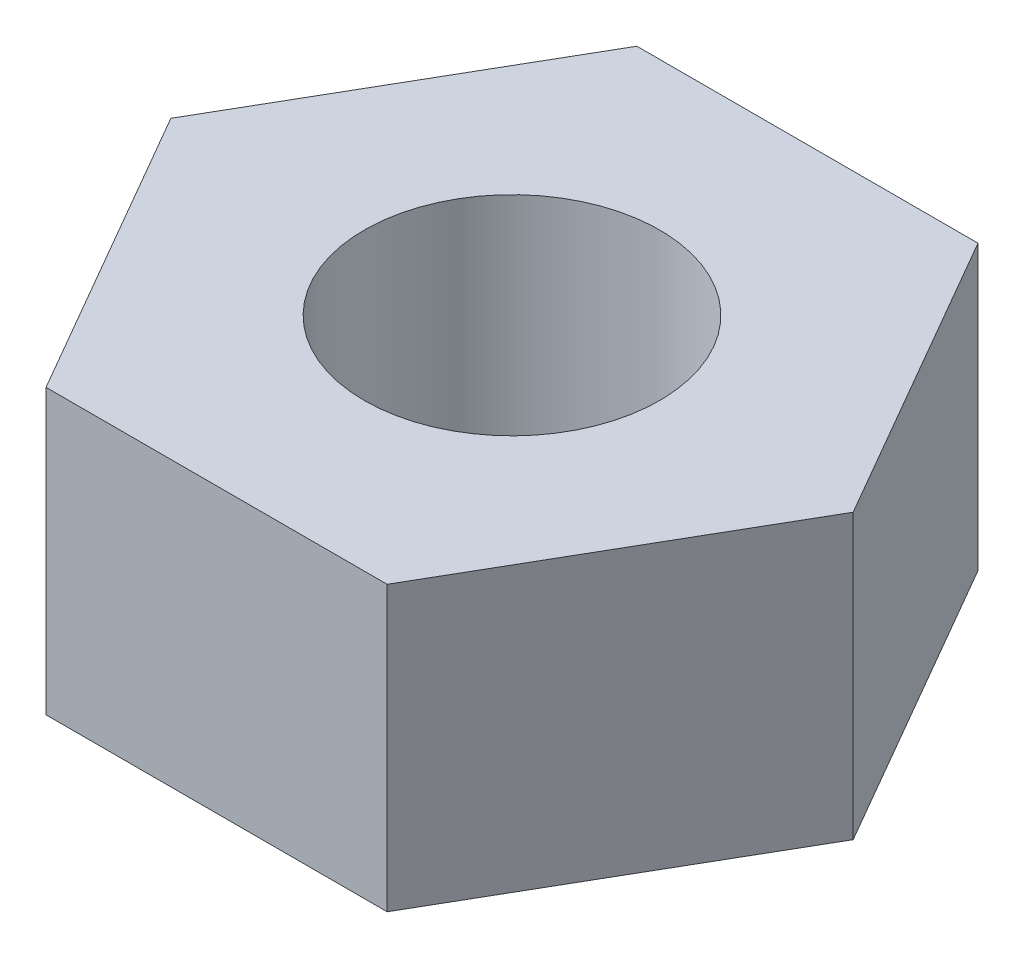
ISO-10303-21;
HEADER;
FILE_DESCRIPTION(('STEP AP214'),'2;1');
FILE_NAME('part.step','',(''),(''),'','','');
FILE_SCHEMA(('AUTOMOTIVE_DESIGN { 1 0 10303 214 1 1 1 1 }'));
ENDSEC;
DATA;
#1=APPLICATION_CONTEXT('core data for automotive mechanical design processes');
#2=APPLICATION_PROTOCOL_DEFINITION('international standard','automotive_design',2000,#1);
#3=PRODUCT_CONTEXT('',#1,'mechanical');
#4=PRODUCT('Part','Part','',(#3));
#5=PRODUCT_RELATED_PRODUCT_CATEGORY('part','',(#4));
#6=PRODUCT_DEFINITION_FORMATION('','',#4);
#7=PRODUCT_DEFINITION_CONTEXT('part definition',#1,'design');
#8=PRODUCT_DEFINITION('design','',#6,#7);
#9=PRODUCT_DEFINITION_SHAPE('','',#8);
#10=(LENGTH_UNIT() NAMED_UNIT(*) SI_UNIT(.MILLI.,.METRE.));
#11=(NAMED_UNIT(*) PLANE_ANGLE_UNIT() SI_UNIT($,.RADIAN.));
#12=(NAMED_UNIT(*) SI_UNIT($,.STERADIAN.) SOLID_ANGLE_UNIT());
#13=UNCERTAINTY_MEASURE_WITH_UNIT(LENGTH_MEASURE(1.E-05),#10,'distance_accuracy_value','');
#14=(GEOMETRIC_REPRESENTATION_CONTEXT(3) GLOBAL_UNCERTAINTY_ASSIGNED_CONTEXT((#13)) GLOBAL_UNIT_ASSIGNED_CONTEXT((#10,
#11,#12)) REPRESENTATION_CONTEXT('',''));
#15=CARTESIAN_POINT('',(0.,0.,0.));
#16=DIRECTION('',(0.,0.,1.));
#17=DIRECTION('',(1.,0.,0.));
#18=AXIS2_PLACEMENT_3D('',#15,#16,#17);
#19=CARTESIAN_POINT('',(2.8867513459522,4.79999999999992,5.00000000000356));
#20=DIRECTION('',(-0.866025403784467,0.,-0.500000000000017));
#21=DIRECTION('',(-0.500000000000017,0.,0.866025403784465));
#22=AXIS2_PLACEMENT_3D('',#19,#20,#21);
#23=PLANE('',#22);
#24=DIRECTION('',(0.500000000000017,0.,-0.866025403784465));
#25=VECTOR('',#24,1.);
#26=CARTESIAN_POINT('',(2.88675134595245,0.,5.00000000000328));
#27=LINE('',#26,#25);
#28=CARTESIAN_POINT('',(2.88675134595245,0.,5.00000000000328));
#29=VERTEX_POINT('',#28);
#30=CARTESIAN_POINT('',(5.7735026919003,-3.33066907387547E-12,4.21884749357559E-12));
#31=VERTEX_POINT('',#30);
#32=EDGE_CURVE('E99',#29,#31,#27,.T.);
#33=ORIENTED_EDGE('',*,*,#32,.T.);
#34=DIRECTION('',(0.,-1.,0.));
#35=VECTOR('',#34,1.);
#36=CARTESIAN_POINT('',(5.77350269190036,4.79999999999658,4.16333634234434E-12));
#37=LINE('',#36,#35);
#38=CARTESIAN_POINT('',(5.77350269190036,4.79999999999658,4.16333634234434E-12));
#39=VERTEX_POINT('',#38);
#40=EDGE_CURVE('E11',#39,#31,#37,.T.);
#41=ORIENTED_EDGE('',*,*,#40,.F.);
#42=DIRECTION('',(0.500000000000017,0.,-0.866025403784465));
#43=VECTOR('',#42,1.);
#44=CARTESIAN_POINT('',(2.8867513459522,4.79999999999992,5.00000000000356));
#45=LINE('',#44,#43);
#46=CARTESIAN_POINT('',(2.8867513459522,4.79999999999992,5.00000000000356));
#47=VERTEX_POINT('',#46);
#48=EDGE_CURVE('E136',#47,#39,#45,.T.);
#49=ORIENTED_EDGE('',*,*,#48,.F.);
#50=DIRECTION('',(0.,-1.,0.));
#51=VECTOR('',#50,1.);
#52=CARTESIAN_POINT('',(2.8867513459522,4.79999999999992,5.00000000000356));
#53=LINE('',#52,#51);
#54=EDGE_CURVE('E113',#47,#29,#53,.T.);
#55=ORIENTED_EDGE('',*,*,#54,.T.);
#56=EDGE_LOOP('',(#33,#41,#49,#55));
#57=FACE_BOUND('',#56,.T.);
#58=ADVANCED_FACE('F42',(#57),#23,.F.);
#59=CARTESIAN_POINT('',(5.77350269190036,4.79999999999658,4.16333634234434E-12));
#60=DIRECTION('',(-0.866025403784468,0.,0.500000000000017));
#61=DIRECTION('',(0.500000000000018,0.,0.866025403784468));
#62=AXIS2_PLACEMENT_3D('',#59,#60,#61);
#63=PLANE('',#62);
#64=DIRECTION('',(-0.500000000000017,0.,-0.866025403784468));
#65=VECTOR('',#64,1.);
#66=CARTESIAN_POINT('',(5.7735026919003,-3.33066907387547E-12,4.21884749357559E-12));
#67=LINE('',#66,#65);
#68=CARTESIAN_POINT('',(2.88675134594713,0.,-4.99999999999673));
#69=VERTEX_POINT('',#68);
#70=EDGE_CURVE('E95',#31,#69,#67,.T.);
#71=ORIENTED_EDGE('',*,*,#70,.T.);
#72=DIRECTION('',(0.,-1.,0.));
#73=VECTOR('',#72,1.);
#74=CARTESIAN_POINT('',(2.88675134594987,4.79999999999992,-4.99999999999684));
#75=LINE('',#74,#73);
#76=CARTESIAN_POINT('',(2.88675134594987,4.79999999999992,-4.99999999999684));
#77=VERTEX_POINT('',#76);
#78=EDGE_CURVE('E50',#77,#69,#75,.T.);
#79=ORIENTED_EDGE('',*,*,#78,.F.);
#80=DIRECTION('',(-0.500000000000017,0.,-0.866025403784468));
#81=VECTOR('',#80,1.);
#82=CARTESIAN_POINT('',(5.77350269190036,4.79999999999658,4.16333634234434E-12));
#83=LINE('',#82,#81);
#84=EDGE_CURVE('E109',#39,#77,#83,.T.);
#85=ORIENTED_EDGE('',*,*,#84,.F.);
#86=ORIENTED_EDGE('',*,*,#40,.T.);
#87=EDGE_LOOP('',(#71,#79,#85,#86));
#88=FACE_BOUND('',#87,.T.);
#89=ADVANCED_FACE('F108',(#88),#63,.F.);
#90=CARTESIAN_POINT('',(2.88675134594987,4.79999999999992,-4.99999999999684));
#91=DIRECTION('',(0.,0.,1.00000000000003));
#92=DIRECTION('',(1.00000000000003,0.,0.));
#93=AXIS2_PLACEMENT_3D('',#90,#91,#92);
#94=PLANE('',#93);
#95=DIRECTION('',(-1.00000000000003,0.,0.));
#96=VECTOR('',#95,1.);
#97=CARTESIAN_POINT('',(2.88675134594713,0.,-4.99999999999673));
#98=LINE('',#97,#96);
#99=CARTESIAN_POINT('',(-2.88675134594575,-3.33066907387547E-12,-4.99999999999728));
#100=VERTEX_POINT('',#99);
#101=EDGE_CURVE('E101',#69,#100,#98,.T.);
#102=ORIENTED_EDGE('',*,*,#101,.T.);
#103=DIRECTION('',(0.,-1.,0.));
#104=VECTOR('',#103,1.);
#105=CARTESIAN_POINT('',(-2.88675134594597,4.79999999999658,-4.9999999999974));
#106=LINE('',#105,#104);
#107=CARTESIAN_POINT('',(-2.88675134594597,4.79999999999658,-4.9999999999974));
#108=VERTEX_POINT('',#107);
#109=EDGE_CURVE('E159',#108,#100,#106,.T.);
#110=ORIENTED_EDGE('',*,*,#109,.F.);
#111=DIRECTION('',(-1.00000000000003,0.,0.));
#112=VECTOR('',#111,1.);
#113=CARTESIAN_POINT('',(2.88675134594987,4.79999999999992,-4.99999999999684));
#114=LINE('',#113,#112);
#115=EDGE_CURVE('E141',#77,#108,#114,.T.);
#116=ORIENTED_EDGE('',*,*,#115,.F.);
#117=ORIENTED_EDGE('',*,*,#78,.T.);
#118=EDGE_LOOP('',(#102,#110,#116,#117));
#119=FACE_BOUND('',#118,.T.);
#120=ADVANCED_FACE('F165',(#119),#94,.F.);
#121=CARTESIAN_POINT('',(-2.88675134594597,4.79999999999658,-4.9999999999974));
#122=DIRECTION('',(0.866025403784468,0.,0.500000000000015));
#123=DIRECTION('',(0.500000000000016,0.,-0.866025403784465));
#124=AXIS2_PLACEMENT_3D('',#121,#122,#123);
#125=PLANE('',#124);
#126=DIRECTION('',(-0.500000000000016,0.,0.866025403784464));
#127=VECTOR('',#126,1.);
#128=CARTESIAN_POINT('',(-2.88675134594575,-3.33066907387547E-12,-4.99999999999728));
#129=LINE('',#128,#127);
#130=CARTESIAN_POINT('',(-5.77350269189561,0.,3.94129173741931E-12));
#131=VERTEX_POINT('',#130);
#132=EDGE_CURVE('E127',#100,#131,#129,.T.);
#133=ORIENTED_EDGE('',*,*,#132,.T.);
#134=DIRECTION('',(0.,-1.,0.));
#135=VECTOR('',#134,1.);
#136=CARTESIAN_POINT('',(-5.77350269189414,4.79999999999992,3.5527136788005E-12));
#137=LINE('',#136,#135);
#138=CARTESIAN_POINT('',(-5.77350269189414,4.79999999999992,3.5527136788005E-12));
#139=VERTEX_POINT('',#138);
#140=EDGE_CURVE('E155',#139,#131,#137,.T.);
#141=ORIENTED_EDGE('',*,*,#140,.F.);
#142=DIRECTION('',(-0.500000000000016,0.,0.866025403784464));
#143=VECTOR('',#142,1.);
#144=CARTESIAN_POINT('',(-2.88675134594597,4.79999999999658,-4.9999999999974));
#145=LINE('',#144,#143);
#146=EDGE_CURVE('E143',#108,#139,#145,.T.);
#147=ORIENTED_EDGE('',*,*,#146,.F.);
#148=ORIENTED_EDGE('',*,*,#109,.T.);
#149=EDGE_LOOP('',(#133,#141,#147,#148));
#150=FACE_BOUND('',#149,.T.);
#151=ADVANCED_FACE('F171',(#150),#125,.F.);
#152=CARTESIAN_POINT('',(-5.77350269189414,4.79999999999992,3.5527136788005E-12));
#153=DIRECTION('',(0.866025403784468,0.,-0.500000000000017));
#154=DIRECTION('',(-0.500000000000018,0.,-0.866025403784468));
#155=AXIS2_PLACEMENT_3D('',#152,#153,#154);
#156=PLANE('',#155);
#157=DIRECTION('',(0.500000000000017,0.,0.866025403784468));
#158=VECTOR('',#157,1.);
#159=CARTESIAN_POINT('',(-5.77350269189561,0.,3.94129173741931E-12));
#160=LINE('',#159,#158);
#161=CARTESIAN_POINT('',(-2.88675134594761,-3.33066907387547E-12,5.00000000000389));
#162=VERTEX_POINT('',#161);
#163=EDGE_CURVE('E130',#131,#162,#160,.T.);
#164=ORIENTED_EDGE('',*,*,#163,.T.);
#165=DIRECTION('',(0.,-1.,0.));
#166=VECTOR('',#165,1.);
#167=CARTESIAN_POINT('',(-2.88675134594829,4.79999999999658,5.000000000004));
#168=LINE('',#167,#166);
#169=CARTESIAN_POINT('',(-2.88675134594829,4.79999999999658,5.000000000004));
#170=VERTEX_POINT('',#169);
#171=EDGE_CURVE('E151',#170,#162,#168,.T.);
#172=ORIENTED_EDGE('',*,*,#171,.F.);
#173=DIRECTION('',(0.500000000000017,0.,0.866025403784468));
#174=VECTOR('',#173,1.);
#175=CARTESIAN_POINT('',(-5.77350269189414,4.79999999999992,3.5527136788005E-12));
#176=LINE('',#175,#174);
#177=EDGE_CURVE('E62',#139,#170,#176,.T.);
#178=ORIENTED_EDGE('',*,*,#177,.F.);
#179=ORIENTED_EDGE('',*,*,#140,.T.);
#180=EDGE_LOOP('',(#164,#172,#178,#179));
#181=FACE_BOUND('',#180,.T.);
#182=ADVANCED_FACE('F174',(#181),#156,.F.);
#183=CARTESIAN_POINT('',(-2.88675134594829,4.79999999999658,5.000000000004));
#184=DIRECTION('',(0.,0.,-1.00000000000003));
#185=DIRECTION('',(-1.00000000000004,0.,0.));
#186=AXIS2_PLACEMENT_3D('',#183,#184,#185);
#187=PLANE('',#186);
#188=DIRECTION('',(1.00000000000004,0.,0.));
#189=VECTOR('',#188,1.);
#190=CARTESIAN_POINT('',(-2.88675134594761,-3.33066907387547E-12,5.00000000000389));
#191=LINE('',#190,#189);
#192=EDGE_CURVE('E133',#162,#29,#191,.T.);
#193=ORIENTED_EDGE('',*,*,#192,.T.);
#194=ORIENTED_EDGE('',*,*,#54,.F.);
#195=DIRECTION('',(1.00000000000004,0.,0.));
#196=VECTOR('',#195,1.);
#197=CARTESIAN_POINT('',(-2.88675134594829,4.79999999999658,5.000000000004));
#198=LINE('',#197,#196);
#199=EDGE_CURVE('E57',#170,#47,#198,.T.);
#200=ORIENTED_EDGE('',*,*,#199,.F.);
#201=ORIENTED_EDGE('',*,*,#171,.T.);
#202=EDGE_LOOP('',(#193,#194,#200,#201));
#203=FACE_BOUND('',#202,.T.);
#204=ADVANCED_FACE('F176',(#203),#187,.F.);
#205=CARTESIAN_POINT('',(5.77350269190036,4.79999999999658,4.16333634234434E-12));
#206=DIRECTION('',(0.,1.,0.));
#207=DIRECTION('',(0.,0.,1.00000000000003));
#208=AXIS2_PLACEMENT_3D('',#205,#206,#207);
#209=PLANE('',#208);
#210=CARTESIAN_POINT('',(1.47104550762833E-12,4.79999999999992,3.77475828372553E-12));
#211=DIRECTION('',(0.,1.,0.));
#212=DIRECTION('',(0.,0.,1.00000000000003));
#213=AXIS2_PLACEMENT_3D('',#210,#211,#212);
#214=CIRCLE('',#213,2.49999999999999);
#215=CARTESIAN_POINT('',(1.47090672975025E-12,4.79999999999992,2.50000000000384));
#216=VERTEX_POINT('',#215);
#217=EDGE_CURVE('E121',#216,#216,#214,.T.);
#218=ORIENTED_EDGE('',*,*,#217,.F.);
#219=EDGE_LOOP('',(#218));
#220=FACE_BOUND('',#219,.T.);
#221=ORIENTED_EDGE('',*,*,#48,.T.);
#222=ORIENTED_EDGE('',*,*,#84,.T.);
#223=ORIENTED_EDGE('',*,*,#115,.T.);
#224=ORIENTED_EDGE('',*,*,#146,.T.);
#225=ORIENTED_EDGE('',*,*,#177,.T.);
#226=ORIENTED_EDGE('',*,*,#199,.T.);
#227=EDGE_LOOP('',(#221,#222,#223,#224,#225,#226));
#228=FACE_BOUND('',#227,.T.);
#229=ADVANCED_FACE('F168',(#220,#228),#209,.T.);
#230=CARTESIAN_POINT('',(5.7735026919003,-3.33066907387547E-12,4.21884749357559E-12));
#231=DIRECTION('',(0.,1.,0.));
#232=DIRECTION('',(0.,0.,1.00000000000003));
#233=AXIS2_PLACEMENT_3D('',#230,#231,#232);
#234=PLANE('',#233);
#235=CARTESIAN_POINT('',(1.80411241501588E-13,0.,2.99760216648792E-12));
#236=DIRECTION('',(0.,1.,0.));
#237=DIRECTION('',(0.,0.,1.00000000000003));
#238=AXIS2_PLACEMENT_3D('',#235,#236,#237);
#239=CIRCLE('',#238,2.5);
#240=CARTESIAN_POINT('',(1.8027246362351E-13,0.,2.50000000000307));
#241=VERTEX_POINT('',#240);
#242=EDGE_CURVE('E115',#241,#241,#239,.T.);
#243=ORIENTED_EDGE('',*,*,#242,.T.);
#244=EDGE_LOOP('',(#243));
#245=FACE_BOUND('',#244,.T.);
#246=ORIENTED_EDGE('',*,*,#32,.F.);
#247=ORIENTED_EDGE('',*,*,#192,.F.);
#248=ORIENTED_EDGE('',*,*,#163,.F.);
#249=ORIENTED_EDGE('',*,*,#132,.F.);
#250=ORIENTED_EDGE('',*,*,#101,.F.);
#251=ORIENTED_EDGE('',*,*,#70,.F.);
#252=EDGE_LOOP('',(#246,#247,#248,#249,#250,#251));
#253=FACE_BOUND('',#252,.T.);
#254=ADVANCED_FACE('F96',(#245,#253),#234,.F.);
#255=CARTESIAN_POINT('',(1.47104550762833E-12,4.79999999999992,3.77475828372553E-12));
#256=DIRECTION('',(0.,1.,0.));
#257=DIRECTION('',(0.,0.,1.00000000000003));
#258=AXIS2_PLACEMENT_3D('',#255,#256,#257);
#259=CYLINDRICAL_SURFACE('',#258,2.49999999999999);
#260=ORIENTED_EDGE('',*,*,#242,.F.);
#261=EDGE_LOOP('',(#260));
#262=FACE_BOUND('',#261,.T.);
#263=ORIENTED_EDGE('',*,*,#217,.T.);
#264=EDGE_LOOP('',(#263));
#265=FACE_BOUND('',#264,.T.);
#266=ADVANCED_FACE('F220',(#262,#265),#259,.F.);
#267=CLOSED_SHELL('',(#58,#89,#120,#151,#182,#204,#229,#254,#266));
#268=MANIFOLD_SOLID_BREP('B2',#267);
#269=ADVANCED_BREP_SHAPE_REPRESENTATION('',(#18,#268),#14);
#270=SHAPE_DEFINITION_REPRESENTATION(#9,#269);
ENDSEC;
END-ISO-10303-21;
